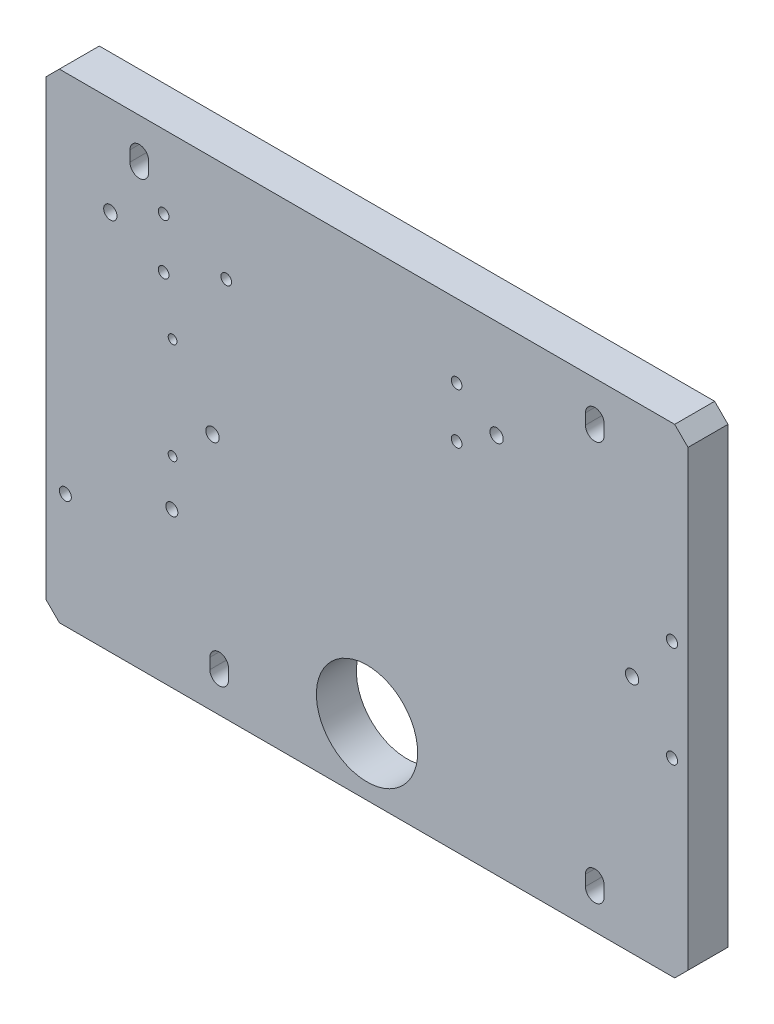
ISO-10303-21;
HEADER;
FILE_DESCRIPTION(('STEP AP214'),'2;1');
FILE_NAME('part.step','',(''),(''),'','','');
FILE_SCHEMA(('AUTOMOTIVE_DESIGN { 1 0 10303 214 1 1 1 1 }'));
ENDSEC;
DATA;
#1=APPLICATION_CONTEXT('core data for automotive mechanical design processes');
#2=APPLICATION_PROTOCOL_DEFINITION('international standard','automotive_design',2000,#1);
#3=PRODUCT_CONTEXT('',#1,'mechanical');
#4=PRODUCT('Part','Part','',(#3));
#5=PRODUCT_RELATED_PRODUCT_CATEGORY('part','',(#4));
#6=PRODUCT_DEFINITION_FORMATION('','',#4);
#7=PRODUCT_DEFINITION_CONTEXT('part definition',#1,'design');
#8=PRODUCT_DEFINITION('design','',#6,#7);
#9=PRODUCT_DEFINITION_SHAPE('','',#8);
#10=(LENGTH_UNIT() NAMED_UNIT(*) SI_UNIT(.MILLI.,.METRE.));
#11=(NAMED_UNIT(*) PLANE_ANGLE_UNIT() SI_UNIT($,.RADIAN.));
#12=(NAMED_UNIT(*) SI_UNIT($,.STERADIAN.) SOLID_ANGLE_UNIT());
#13=UNCERTAINTY_MEASURE_WITH_UNIT(LENGTH_MEASURE(1.E-05),#10,'distance_accuracy_value','');
#14=(GEOMETRIC_REPRESENTATION_CONTEXT(3) GLOBAL_UNCERTAINTY_ASSIGNED_CONTEXT((#13)) GLOBAL_UNIT_ASSIGNED_CONTEXT((#10,
#11,#12)) REPRESENTATION_CONTEXT('',''));
#15=CARTESIAN_POINT('',(0.,0.,0.));
#16=DIRECTION('',(0.,0.,1.));
#17=DIRECTION('',(1.,0.,0.));
#18=AXIS2_PLACEMENT_3D('',#15,#16,#17);
#19=CARTESIAN_POINT('',(0.,0.,5.));
#20=DIRECTION('',(0.,0.,-1.));
#21=DIRECTION('',(1.,0.,0.));
#22=AXIS2_PLACEMENT_3D('',#19,#20,#21);
#23=PLANE('',#22);
#24=CARTESIAN_POINT('',(-93.7499999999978,-14.5948159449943,5.));
#25=DIRECTION('',(0.,0.,1.));
#26=DIRECTION('',(-1.,0.,0.));
#27=AXIS2_PLACEMENT_3D('',#24,#25,#26);
#28=CIRCLE('',#27,1.65);
#29=CARTESIAN_POINT('',(-95.3999999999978,-14.5948159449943,5.));
#30=VERTEX_POINT('',#29);
#31=EDGE_CURVE('E808',#30,#30,#28,.T.);
#32=ORIENTED_EDGE('',*,*,#31,.F.);
#33=EDGE_LOOP('',(#32));
#34=FACE_BOUND('',#33,.T.);
#35=CARTESIAN_POINT('',(-78.75,0.,5.));
#36=DIRECTION('',(0.,0.,1.));
#37=DIRECTION('',(1.,0.,0.));
#38=AXIS2_PLACEMENT_3D('',#35,#36,#37);
#39=CIRCLE('',#38,2.5);
#40=CARTESIAN_POINT('',(-76.25,0.,5.));
#41=VERTEX_POINT('',#40);
#42=EDGE_CURVE('E818',#41,#41,#39,.T.);
#43=ORIENTED_EDGE('',*,*,#42,.F.);
#44=EDGE_LOOP('',(#43));
#45=FACE_BOUND('',#44,.T.);
#46=CARTESIAN_POINT('',(78.75,0.,5.));
#47=DIRECTION('',(0.,0.,1.));
#48=DIRECTION('',(1.,0.,0.));
#49=AXIS2_PLACEMENT_3D('',#46,#47,#48);
#50=CIRCLE('',#49,2.5);
#51=CARTESIAN_POINT('',(81.25,0.,5.));
#52=VERTEX_POINT('',#51);
#53=EDGE_CURVE('E824',#52,#52,#50,.T.);
#54=ORIENTED_EDGE('',*,*,#53,.F.);
#55=EDGE_LOOP('',(#54));
#56=FACE_BOUND('',#55,.T.);
#57=CARTESIAN_POINT('',(-117.109999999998,53.,5.));
#58=DIRECTION('',(0.,0.,1.));
#59=DIRECTION('',(1.,0.,0.));
#60=AXIS2_PLACEMENT_3D('',#57,#58,#59);
#61=CIRCLE('',#60,2.5);
#62=CARTESIAN_POINT('',(-114.609999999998,53.,5.));
#63=VERTEX_POINT('',#62);
#64=EDGE_CURVE('E830',#63,#63,#61,.T.);
#65=ORIENTED_EDGE('',*,*,#64,.F.);
#66=EDGE_LOOP('',(#65));
#67=FACE_BOUND('',#66,.T.);
#68=CARTESIAN_POINT('',(27.8900000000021,53.,5.));
#69=DIRECTION('',(0.,0.,1.));
#70=DIRECTION('',(1.,0.,0.));
#71=AXIS2_PLACEMENT_3D('',#68,#69,#70);
#72=CIRCLE('',#71,2.5);
#73=CARTESIAN_POINT('',(30.3900000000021,53.,5.));
#74=VERTEX_POINT('',#73);
#75=EDGE_CURVE('E836',#74,#74,#72,.T.);
#76=ORIENTED_EDGE('',*,*,#75,.F.);
#77=EDGE_LOOP('',(#76));
#78=FACE_BOUND('',#77,.T.);
#79=CARTESIAN_POINT('',(93.75,19.,5.));
#80=DIRECTION('',(0.,0.,1.));
#81=DIRECTION('',(1.,0.,0.));
#82=AXIS2_PLACEMENT_3D('',#79,#80,#81);
#83=CIRCLE('',#82,2.1);
#84=CARTESIAN_POINT('',(95.85,19.,5.));
#85=VERTEX_POINT('',#84);
#86=EDGE_CURVE('E842',#85,#85,#83,.T.);
#87=ORIENTED_EDGE('',*,*,#86,.F.);
#88=EDGE_LOOP('',(#87));
#89=FACE_BOUND('',#88,.T.);
#90=CARTESIAN_POINT('',(93.75,-19.,5.));
#91=DIRECTION('',(0.,0.,1.));
#92=DIRECTION('',(1.,0.,0.));
#93=AXIS2_PLACEMENT_3D('',#90,#91,#92);
#94=CIRCLE('',#93,2.1);
#95=CARTESIAN_POINT('',(95.85,-19.,5.));
#96=VERTEX_POINT('',#95);
#97=EDGE_CURVE('E848',#96,#96,#94,.T.);
#98=ORIENTED_EDGE('',*,*,#97,.F.);
#99=EDGE_LOOP('',(#98));
#100=FACE_BOUND('',#99,.T.);
#101=CARTESIAN_POINT('',(-20.75,-65.,5.));
#102=DIRECTION('',(0.,0.,1.));
#103=DIRECTION('',(1.,0.,0.));
#104=AXIS2_PLACEMENT_3D('',#101,#102,#103);
#105=CIRCLE('',#104,19.);
#106=CARTESIAN_POINT('',(-1.75,-65.,5.));
#107=VERTEX_POINT('',#106);
#108=EDGE_CURVE('E854',#107,#107,#105,.T.);
#109=ORIENTED_EDGE('',*,*,#108,.F.);
#110=EDGE_LOOP('',(#109));
#111=FACE_BOUND('',#110,.T.);
#112=CARTESIAN_POINT('',(-94.01,-32.,5.));
#113=DIRECTION('',(0.,0.,1.));
#114=DIRECTION('',(1.,0.,0.));
#115=AXIS2_PLACEMENT_3D('',#112,#113,#114);
#116=CIRCLE('',#115,2.25);
#117=CARTESIAN_POINT('',(-91.76,-32.,5.));
#118=VERTEX_POINT('',#117);
#119=EDGE_CURVE('E869',#118,#118,#116,.T.);
#120=ORIENTED_EDGE('',*,*,#119,.F.);
#121=EDGE_LOOP('',(#120));
#122=FACE_BOUND('',#121,.T.);
#123=CARTESIAN_POINT('',(-134.01,-47.,5.));
#124=DIRECTION('',(0.,0.,1.));
#125=DIRECTION('',(1.,0.,0.));
#126=AXIS2_PLACEMENT_3D('',#123,#124,#125);
#127=CIRCLE('',#126,2.25);
#128=CARTESIAN_POINT('',(-131.76,-47.,5.));
#129=VERTEX_POINT('',#128);
#130=EDGE_CURVE('E881',#129,#129,#127,.T.);
#131=ORIENTED_EDGE('',*,*,#130,.F.);
#132=EDGE_LOOP('',(#131));
#133=FACE_BOUND('',#132,.T.);
#134=CARTESIAN_POINT('',(-97.11,43.5,5.));
#135=DIRECTION('',(0.,0.,-1.));
#136=DIRECTION('',(-1.,0.,0.));
#137=AXIS2_PLACEMENT_3D('',#134,#135,#136);
#138=CIRCLE('',#137,2.);
#139=CARTESIAN_POINT('',(-99.11,43.5,5.));
#140=VERTEX_POINT('',#139);
#141=EDGE_CURVE('E884',#140,#140,#138,.T.);
#142=ORIENTED_EDGE('',*,*,#141,.T.);
#143=EDGE_LOOP('',(#142));
#144=FACE_BOUND('',#143,.T.);
#145=CARTESIAN_POINT('',(12.89,62.5,5.));
#146=DIRECTION('',(0.,0.,-1.));
#147=DIRECTION('',(-1.,0.,0.));
#148=AXIS2_PLACEMENT_3D('',#145,#146,#147);
#149=CIRCLE('',#148,2.);
#150=CARTESIAN_POINT('',(10.89,62.5,5.));
#151=VERTEX_POINT('',#150);
#152=EDGE_CURVE('E890',#151,#151,#149,.T.);
#153=ORIENTED_EDGE('',*,*,#152,.T.);
#154=EDGE_LOOP('',(#153));
#155=FACE_BOUND('',#154,.T.);
#156=CARTESIAN_POINT('',(-97.11,62.5,5.));
#157=DIRECTION('',(0.,0.,-1.));
#158=DIRECTION('',(-1.,0.,0.));
#159=AXIS2_PLACEMENT_3D('',#156,#157,#158);
#160=CIRCLE('',#159,2.);
#161=CARTESIAN_POINT('',(-99.11,62.5,5.));
#162=VERTEX_POINT('',#161);
#163=EDGE_CURVE('E896',#162,#162,#160,.T.);
#164=ORIENTED_EDGE('',*,*,#163,.T.);
#165=EDGE_LOOP('',(#164));
#166=FACE_BOUND('',#165,.T.);
#167=CARTESIAN_POINT('',(-73.61,53.,5.));
#168=DIRECTION('',(0.,0.,1.));
#169=DIRECTION('',(1.,0.,0.));
#170=AXIS2_PLACEMENT_3D('',#167,#168,#169);
#171=CIRCLE('',#170,2.);
#172=CARTESIAN_POINT('',(-71.61,53.,5.));
#173=VERTEX_POINT('',#172);
#174=EDGE_CURVE('E905',#173,#173,#171,.T.);
#175=ORIENTED_EDGE('',*,*,#174,.F.);
#176=EDGE_LOOP('',(#175));
#177=FACE_BOUND('',#176,.T.);
#178=CARTESIAN_POINT('',(12.89,43.5,5.));
#179=DIRECTION('',(0.,0.,1.));
#180=DIRECTION('',(1.,0.,0.));
#181=AXIS2_PLACEMENT_3D('',#178,#179,#180);
#182=CIRCLE('',#181,2.);
#183=CARTESIAN_POINT('',(14.89,43.5,5.));
#184=VERTEX_POINT('',#183);
#185=EDGE_CURVE('E210',#184,#184,#182,.T.);
#186=ORIENTED_EDGE('',*,*,#185,.F.);
#187=EDGE_LOOP('',(#186));
#188=FACE_BOUND('',#187,.T.);
#189=DIRECTION('',(0.,-1.,0.));
#190=VECTOR('',#189,1.);
#191=CARTESIAN_POINT('',(-102.75,77.,5.));
#192=LINE('',#191,#190);
#193=CARTESIAN_POINT('',(-102.75,77.,5.));
#194=VERTEX_POINT('',#193);
#195=CARTESIAN_POINT('',(-102.75,73.,5.));
#196=VERTEX_POINT('',#195);
#197=EDGE_CURVE('E184',#194,#196,#192,.T.);
#198=ORIENTED_EDGE('',*,*,#197,.T.);
#199=CARTESIAN_POINT('',(-106.25,73.,5.));
#200=DIRECTION('',(0.,0.,-1.));
#201=DIRECTION('',(-1.,0.,0.));
#202=AXIS2_PLACEMENT_3D('',#199,#200,#201);
#203=CIRCLE('',#202,3.5);
#204=CARTESIAN_POINT('',(-109.75,73.,5.));
#205=VERTEX_POINT('',#204);
#206=EDGE_CURVE('E207',#196,#205,#203,.T.);
#207=ORIENTED_EDGE('',*,*,#206,.T.);
#208=DIRECTION('',(0.,1.,0.));
#209=VECTOR('',#208,1.);
#210=CARTESIAN_POINT('',(-109.75,73.,5.));
#211=LINE('',#210,#209);
#212=CARTESIAN_POINT('',(-109.75,77.,5.));
#213=VERTEX_POINT('',#212);
#214=EDGE_CURVE('E204',#205,#213,#211,.T.);
#215=ORIENTED_EDGE('',*,*,#214,.T.);
#216=CARTESIAN_POINT('',(-106.25,77.,5.));
#217=DIRECTION('',(0.,0.,-1.));
#218=DIRECTION('',(-1.,0.,0.));
#219=AXIS2_PLACEMENT_3D('',#216,#217,#218);
#220=CIRCLE('',#219,3.5);
#221=EDGE_CURVE('E215',#213,#194,#220,.T.);
#222=ORIENTED_EDGE('',*,*,#221,.T.);
#223=EDGE_LOOP('',(#198,#207,#215,#222));
#224=FACE_BOUND('',#223,.T.);
#225=DIRECTION('',(0.,-1.,0.));
#226=VECTOR('',#225,1.);
#227=CARTESIAN_POINT('',(61.25,77.,5.));
#228=LINE('',#227,#226);
#229=CARTESIAN_POINT('',(61.25,77.,5.));
#230=VERTEX_POINT('',#229);
#231=CARTESIAN_POINT('',(61.25,73.,5.));
#232=VERTEX_POINT('',#231);
#233=EDGE_CURVE('E235',#230,#232,#228,.T.);
#234=ORIENTED_EDGE('',*,*,#233,.F.);
#235=CARTESIAN_POINT('',(64.75,77.,5.));
#236=DIRECTION('',(0.,0.,1.));
#237=DIRECTION('',(1.,0.,0.));
#238=AXIS2_PLACEMENT_3D('',#235,#236,#237);
#239=CIRCLE('',#238,3.5);
#240=CARTESIAN_POINT('',(68.25,77.,5.));
#241=VERTEX_POINT('',#240);
#242=EDGE_CURVE('E232',#241,#230,#239,.T.);
#243=ORIENTED_EDGE('',*,*,#242,.F.);
#244=DIRECTION('',(0.,1.,0.));
#245=VECTOR('',#244,1.);
#246=CARTESIAN_POINT('',(68.25,73.,5.));
#247=LINE('',#246,#245);
#248=CARTESIAN_POINT('',(68.25,73.,5.));
#249=VERTEX_POINT('',#248);
#250=EDGE_CURVE('E228',#249,#241,#247,.T.);
#251=ORIENTED_EDGE('',*,*,#250,.F.);
#252=CARTESIAN_POINT('',(64.75,73.,5.));
#253=DIRECTION('',(0.,0.,1.));
#254=DIRECTION('',(1.,0.,0.));
#255=AXIS2_PLACEMENT_3D('',#252,#253,#254);
#256=CIRCLE('',#255,3.5);
#257=EDGE_CURVE('E225',#232,#249,#256,.T.);
#258=ORIENTED_EDGE('',*,*,#257,.F.);
#259=EDGE_LOOP('',(#234,#243,#251,#258));
#260=FACE_BOUND('',#259,.T.);
#261=DIRECTION('',(0.,-1.,0.));
#262=VECTOR('',#261,1.);
#263=CARTESIAN_POINT('',(61.25,-73.,5.));
#264=LINE('',#263,#262);
#265=CARTESIAN_POINT('',(61.25,-73.,5.));
#266=VERTEX_POINT('',#265);
#267=CARTESIAN_POINT('',(61.25,-77.,5.));
#268=VERTEX_POINT('',#267);
#269=EDGE_CURVE('E267',#266,#268,#264,.T.);
#270=ORIENTED_EDGE('',*,*,#269,.F.);
#271=CARTESIAN_POINT('',(64.75,-73.,5.));
#272=DIRECTION('',(0.,0.,1.));
#273=DIRECTION('',(1.,0.,0.));
#274=AXIS2_PLACEMENT_3D('',#271,#272,#273);
#275=CIRCLE('',#274,3.5);
#276=CARTESIAN_POINT('',(68.25,-73.,5.));
#277=VERTEX_POINT('',#276);
#278=EDGE_CURVE('E264',#277,#266,#275,.T.);
#279=ORIENTED_EDGE('',*,*,#278,.F.);
#280=DIRECTION('',(0.,1.,0.));
#281=VECTOR('',#280,1.);
#282=CARTESIAN_POINT('',(68.25,-77.,5.));
#283=LINE('',#282,#281);
#284=CARTESIAN_POINT('',(68.25,-77.,5.));
#285=VERTEX_POINT('',#284);
#286=EDGE_CURVE('E260',#285,#277,#283,.T.);
#287=ORIENTED_EDGE('',*,*,#286,.F.);
#288=CARTESIAN_POINT('',(64.75,-77.,5.));
#289=DIRECTION('',(0.,0.,1.));
#290=DIRECTION('',(1.,0.,0.));
#291=AXIS2_PLACEMENT_3D('',#288,#289,#290);
#292=CIRCLE('',#291,3.5);
#293=EDGE_CURVE('E257',#268,#285,#292,.T.);
#294=ORIENTED_EDGE('',*,*,#293,.F.);
#295=EDGE_LOOP('',(#270,#279,#287,#294));
#296=FACE_BOUND('',#295,.T.);
#297=DIRECTION('',(0.,1.,0.));
#298=VECTOR('',#297,1.);
#299=CARTESIAN_POINT('',(-72.75,-77.,5.));
#300=LINE('',#299,#298);
#301=CARTESIAN_POINT('',(-72.75,-77.,5.));
#302=VERTEX_POINT('',#301);
#303=CARTESIAN_POINT('',(-72.75,-73.,5.));
#304=VERTEX_POINT('',#303);
#305=EDGE_CURVE('E299',#302,#304,#300,.T.);
#306=ORIENTED_EDGE('',*,*,#305,.F.);
#307=CARTESIAN_POINT('',(-76.25,-77.,5.));
#308=DIRECTION('',(0.,0.,1.));
#309=DIRECTION('',(1.,0.,0.));
#310=AXIS2_PLACEMENT_3D('',#307,#308,#309);
#311=CIRCLE('',#310,3.5);
#312=CARTESIAN_POINT('',(-79.75,-77.,5.));
#313=VERTEX_POINT('',#312);
#314=EDGE_CURVE('E296',#313,#302,#311,.T.);
#315=ORIENTED_EDGE('',*,*,#314,.F.);
#316=DIRECTION('',(0.,-1.,0.));
#317=VECTOR('',#316,1.);
#318=CARTESIAN_POINT('',(-79.75,-73.,5.));
#319=LINE('',#318,#317);
#320=CARTESIAN_POINT('',(-79.75,-73.,5.));
#321=VERTEX_POINT('',#320);
#322=EDGE_CURVE('E292',#321,#313,#319,.T.);
#323=ORIENTED_EDGE('',*,*,#322,.F.);
#324=CARTESIAN_POINT('',(-76.25,-73.,5.));
#325=DIRECTION('',(0.,0.,1.));
#326=DIRECTION('',(1.,0.,0.));
#327=AXIS2_PLACEMENT_3D('',#324,#325,#326);
#328=CIRCLE('',#327,3.5);
#329=EDGE_CURVE('E289',#304,#321,#328,.T.);
#330=ORIENTED_EDGE('',*,*,#329,.F.);
#331=EDGE_LOOP('',(#306,#315,#323,#330));
#332=FACE_BOUND('',#331,.T.);
#333=DIRECTION('',(1.,0.,0.));
#334=VECTOR('',#333,1.);
#335=CARTESIAN_POINT('',(-141.25,-90.,5.));
#336=LINE('',#335,#334);
#337=CARTESIAN_POINT('',(-136.25,-90.,5.));
#338=VERTEX_POINT('',#337);
#339=CARTESIAN_POINT('',(94.75,-90.,5.));
#340=VERTEX_POINT('',#339);
#341=EDGE_CURVE('E328',#338,#340,#336,.T.);
#342=ORIENTED_EDGE('',*,*,#341,.T.);
#343=DIRECTION('',(0.707106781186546,0.707106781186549,0.));
#344=VECTOR('',#343,1.);
#345=CARTESIAN_POINT('',(94.75,-90.,5.));
#346=LINE('',#345,#344);
#347=CARTESIAN_POINT('',(99.75,-85.,5.));
#348=VERTEX_POINT('',#347);
#349=EDGE_CURVE('E38',#348,#340,#346,.F.);
#350=ORIENTED_EDGE('',*,*,#349,.F.);
#351=DIRECTION('',(0.,1.,0.));
#352=VECTOR('',#351,1.);
#353=CARTESIAN_POINT('',(99.75,-90.,5.));
#354=LINE('',#353,#352);
#355=CARTESIAN_POINT('',(99.75,85.,5.));
#356=VERTEX_POINT('',#355);
#357=EDGE_CURVE('E330',#348,#356,#354,.T.);
#358=ORIENTED_EDGE('',*,*,#357,.T.);
#359=DIRECTION('',(-0.707106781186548,0.707106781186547,0.));
#360=VECTOR('',#359,1.);
#361=CARTESIAN_POINT('',(99.75,85.,5.));
#362=LINE('',#361,#360);
#363=CARTESIAN_POINT('',(94.75,90.,5.));
#364=VERTEX_POINT('',#363);
#365=EDGE_CURVE('E31',#364,#356,#362,.F.);
#366=ORIENTED_EDGE('',*,*,#365,.F.);
#367=DIRECTION('',(-1.,0.,0.));
#368=VECTOR('',#367,1.);
#369=CARTESIAN_POINT('',(99.75,90.,5.));
#370=LINE('',#369,#368);
#371=CARTESIAN_POINT('',(-136.25,90.,5.));
#372=VERTEX_POINT('',#371);
#373=EDGE_CURVE('E321',#364,#372,#370,.T.);
#374=ORIENTED_EDGE('',*,*,#373,.T.);
#375=DIRECTION('',(-0.707106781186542,-0.707106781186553,0.));
#376=VECTOR('',#375,1.);
#377=CARTESIAN_POINT('',(-136.25,90.,5.));
#378=LINE('',#377,#376);
#379=CARTESIAN_POINT('',(-141.25,85.,5.));
#380=VERTEX_POINT('',#379);
#381=EDGE_CURVE('E363',#380,#372,#378,.F.);
#382=ORIENTED_EDGE('',*,*,#381,.F.);
#383=DIRECTION('',(0.,-1.,0.));
#384=VECTOR('',#383,1.);
#385=CARTESIAN_POINT('',(-141.25,90.,5.));
#386=LINE('',#385,#384);
#387=CARTESIAN_POINT('',(-141.25,-85.,5.));
#388=VERTEX_POINT('',#387);
#389=EDGE_CURVE('E324',#380,#388,#386,.T.);
#390=ORIENTED_EDGE('',*,*,#389,.T.);
#391=DIRECTION('',(0.707106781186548,-0.707106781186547,0.));
#392=VECTOR('',#391,1.);
#393=CARTESIAN_POINT('',(-141.25,-85.,5.));
#394=LINE('',#393,#392);
#395=EDGE_CURVE('E366',#338,#388,#394,.F.);
#396=ORIENTED_EDGE('',*,*,#395,.F.);
#397=EDGE_LOOP('',(#342,#350,#358,#366,#374,#382,#390,#396));
#398=FACE_BOUND('',#397,.T.);
#399=CARTESIAN_POINT('',(-93.7499999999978,23.4051840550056,5.));
#400=DIRECTION('',(0.,0.,1.));
#401=DIRECTION('',(-1.,0.,0.));
#402=AXIS2_PLACEMENT_3D('',#399,#400,#401);
#403=CIRCLE('',#402,1.65);
#404=CARTESIAN_POINT('',(-95.3999999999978,23.4051840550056,5.));
#405=VERTEX_POINT('',#404);
#406=EDGE_CURVE('E810',#405,#405,#403,.T.);
#407=ORIENTED_EDGE('',*,*,#406,.F.);
#408=EDGE_LOOP('',(#407));
#409=FACE_BOUND('',#408,.T.);
#410=ADVANCED_FACE('F16',(#34,#45,#56,#67,#78,#89,#100,#111,#122,#133,#144,#155,#166,#177,#188,
#224,#260,#296,#332,#398,#409),#23,.F.);
#411=CARTESIAN_POINT('',(99.75,90.,5.));
#412=DIRECTION('',(0.,1.,0.));
#413=DIRECTION('',(0.,0.,-1.));
#414=AXIS2_PLACEMENT_3D('',#411,#412,#413);
#415=PLANE('',#414);
#416=ORIENTED_EDGE('',*,*,#373,.F.);
#417=DIRECTION('',(0.,0.,1.));
#418=VECTOR('',#417,1.);
#419=CARTESIAN_POINT('',(94.75,90.,5.));
#420=LINE('',#419,#418);
#421=CARTESIAN_POINT('',(94.75,90.,-10.));
#422=VERTEX_POINT('',#421);
#423=EDGE_CURVE('E24',#422,#364,#420,.T.);
#424=ORIENTED_EDGE('',*,*,#423,.F.);
#425=DIRECTION('',(-1.,0.,0.));
#426=VECTOR('',#425,1.);
#427=CARTESIAN_POINT('',(99.75,90.,-10.));
#428=LINE('',#427,#426);
#429=CARTESIAN_POINT('',(-136.25,90.,-10.));
#430=VERTEX_POINT('',#429);
#431=EDGE_CURVE('E315',#422,#430,#428,.T.);
#432=ORIENTED_EDGE('',*,*,#431,.T.);
#433=DIRECTION('',(0.,0.,-1.));
#434=VECTOR('',#433,1.);
#435=CARTESIAN_POINT('',(-136.25,90.,5.));
#436=LINE('',#435,#434);
#437=EDGE_CURVE('E11',#372,#430,#436,.T.);
#438=ORIENTED_EDGE('',*,*,#437,.F.);
#439=EDGE_LOOP('',(#416,#424,#432,#438));
#440=FACE_BOUND('',#439,.T.);
#441=ADVANCED_FACE('F376',(#440),#415,.T.);
#442=CARTESIAN_POINT('',(99.75,-90.,5.));
#443=DIRECTION('',(1.,0.,0.));
#444=DIRECTION('',(0.,0.,1.));
#445=AXIS2_PLACEMENT_3D('',#442,#443,#444);
#446=PLANE('',#445);
#447=DIRECTION('',(0.,1.,0.));
#448=VECTOR('',#447,1.);
#449=CARTESIAN_POINT('',(99.75,-90.,-10.));
#450=LINE('',#449,#448);
#451=CARTESIAN_POINT('',(99.75,-85.,-10.));
#452=VERTEX_POINT('',#451);
#453=CARTESIAN_POINT('',(99.75,85.,-10.));
#454=VERTEX_POINT('',#453);
#455=EDGE_CURVE('E325',#452,#454,#450,.T.);
#456=ORIENTED_EDGE('',*,*,#455,.T.);
#457=DIRECTION('',(0.,0.,-1.));
#458=VECTOR('',#457,1.);
#459=CARTESIAN_POINT('',(99.75,85.,5.));
#460=LINE('',#459,#458);
#461=EDGE_CURVE('E368',#356,#454,#460,.T.);
#462=ORIENTED_EDGE('',*,*,#461,.F.);
#463=ORIENTED_EDGE('',*,*,#357,.F.);
#464=DIRECTION('',(0.,0.,1.));
#465=VECTOR('',#464,1.);
#466=CARTESIAN_POINT('',(99.75,-85.,5.));
#467=LINE('',#466,#465);
#468=EDGE_CURVE('E370',#452,#348,#467,.T.);
#469=ORIENTED_EDGE('',*,*,#468,.F.);
#470=EDGE_LOOP('',(#456,#462,#463,#469));
#471=FACE_BOUND('',#470,.T.);
#472=ADVANCED_FACE('F382',(#471),#446,.T.);
#473=CARTESIAN_POINT('',(-141.25,-90.,5.));
#474=DIRECTION('',(0.,-1.,0.));
#475=DIRECTION('',(0.,0.,1.));
#476=AXIS2_PLACEMENT_3D('',#473,#474,#475);
#477=PLANE('',#476);
#478=DIRECTION('',(1.,0.,0.));
#479=VECTOR('',#478,1.);
#480=CARTESIAN_POINT('',(-141.25,-90.,-10.));
#481=LINE('',#480,#479);
#482=CARTESIAN_POINT('',(-136.25,-90.,-10.));
#483=VERTEX_POINT('',#482);
#484=CARTESIAN_POINT('',(94.75,-90.,-10.));
#485=VERTEX_POINT('',#484);
#486=EDGE_CURVE('E338',#483,#485,#481,.T.);
#487=ORIENTED_EDGE('',*,*,#486,.T.);
#488=DIRECTION('',(0.,0.,-1.));
#489=VECTOR('',#488,1.);
#490=CARTESIAN_POINT('',(94.75,-90.,5.));
#491=LINE('',#490,#489);
#492=EDGE_CURVE('E356',#340,#485,#491,.T.);
#493=ORIENTED_EDGE('',*,*,#492,.F.);
#494=ORIENTED_EDGE('',*,*,#341,.F.);
#495=DIRECTION('',(0.,0.,1.));
#496=VECTOR('',#495,1.);
#497=CARTESIAN_POINT('',(-136.25,-90.,5.));
#498=LINE('',#497,#496);
#499=EDGE_CURVE('E359',#483,#338,#498,.T.);
#500=ORIENTED_EDGE('',*,*,#499,.F.);
#501=EDGE_LOOP('',(#487,#493,#494,#500));
#502=FACE_BOUND('',#501,.T.);
#503=ADVANCED_FACE('F400',(#502),#477,.T.);
#504=CARTESIAN_POINT('',(-141.25,90.,5.));
#505=DIRECTION('',(-1.,0.,0.));
#506=DIRECTION('',(0.,0.,-1.));
#507=AXIS2_PLACEMENT_3D('',#504,#505,#506);
#508=PLANE('',#507);
#509=ORIENTED_EDGE('',*,*,#389,.F.);
#510=DIRECTION('',(0.,0.,1.));
#511=VECTOR('',#510,1.);
#512=CARTESIAN_POINT('',(-141.25,85.,5.));
#513=LINE('',#512,#511);
#514=CARTESIAN_POINT('',(-141.25,85.,-10.));
#515=VERTEX_POINT('',#514);
#516=EDGE_CURVE('E332',#515,#380,#513,.T.);
#517=ORIENTED_EDGE('',*,*,#516,.F.);
#518=DIRECTION('',(0.,-1.,0.));
#519=VECTOR('',#518,1.);
#520=CARTESIAN_POINT('',(-141.25,90.,-10.));
#521=LINE('',#520,#519);
#522=CARTESIAN_POINT('',(-141.25,-85.,-10.));
#523=VERTEX_POINT('',#522);
#524=EDGE_CURVE('E335',#515,#523,#521,.T.);
#525=ORIENTED_EDGE('',*,*,#524,.T.);
#526=DIRECTION('',(0.,0.,-1.));
#527=VECTOR('',#526,1.);
#528=CARTESIAN_POINT('',(-141.25,-85.,5.));
#529=LINE('',#528,#527);
#530=EDGE_CURVE('E345',#388,#523,#529,.T.);
#531=ORIENTED_EDGE('',*,*,#530,.F.);
#532=EDGE_LOOP('',(#509,#517,#525,#531));
#533=FACE_BOUND('',#532,.T.);
#534=ADVANCED_FACE('F393',(#533),#508,.T.);
#535=CARTESIAN_POINT('',(0.,0.,-10.));
#536=DIRECTION('',(0.,0.,-1.));
#537=DIRECTION('',(1.,0.,0.));
#538=AXIS2_PLACEMENT_3D('',#535,#536,#537);
#539=PLANE('',#538);
#540=CARTESIAN_POINT('',(-93.7499999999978,-14.5948159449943,-10.));
#541=DIRECTION('',(0.,0.,-1.));
#542=DIRECTION('',(1.,0.,0.));
#543=AXIS2_PLACEMENT_3D('',#540,#541,#542);
#544=CIRCLE('',#543,1.65);
#545=CARTESIAN_POINT('',(-92.0999999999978,-14.5948159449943,-10.));
#546=VERTEX_POINT('',#545);
#547=EDGE_CURVE('E806',#546,#546,#544,.T.);
#548=ORIENTED_EDGE('',*,*,#547,.F.);
#549=EDGE_LOOP('',(#548));
#550=FACE_BOUND('',#549,.T.);
#551=CARTESIAN_POINT('',(-93.7499999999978,23.4051840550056,-10.));
#552=DIRECTION('',(0.,0.,-1.));
#553=DIRECTION('',(1.,0.,0.));
#554=AXIS2_PLACEMENT_3D('',#551,#552,#553);
#555=CIRCLE('',#554,1.65);
#556=CARTESIAN_POINT('',(-92.0999999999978,23.4051840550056,-10.));
#557=VERTEX_POINT('',#556);
#558=EDGE_CURVE('E815',#557,#557,#555,.T.);
#559=ORIENTED_EDGE('',*,*,#558,.F.);
#560=EDGE_LOOP('',(#559));
#561=FACE_BOUND('',#560,.T.);
#562=CARTESIAN_POINT('',(-78.75,0.,-10.));
#563=DIRECTION('',(0.,0.,1.));
#564=DIRECTION('',(1.,0.,0.));
#565=AXIS2_PLACEMENT_3D('',#562,#563,#564);
#566=CIRCLE('',#565,2.5);
#567=CARTESIAN_POINT('',(-76.25,0.,-10.));
#568=VERTEX_POINT('',#567);
#569=EDGE_CURVE('E821',#568,#568,#566,.T.);
#570=ORIENTED_EDGE('',*,*,#569,.T.);
#571=EDGE_LOOP('',(#570));
#572=FACE_BOUND('',#571,.T.);
#573=CARTESIAN_POINT('',(78.75,0.,-10.));
#574=DIRECTION('',(0.,0.,1.));
#575=DIRECTION('',(1.,0.,0.));
#576=AXIS2_PLACEMENT_3D('',#573,#574,#575);
#577=CIRCLE('',#576,2.5);
#578=CARTESIAN_POINT('',(81.25,0.,-10.));
#579=VERTEX_POINT('',#578);
#580=EDGE_CURVE('E827',#579,#579,#577,.T.);
#581=ORIENTED_EDGE('',*,*,#580,.T.);
#582=EDGE_LOOP('',(#581));
#583=FACE_BOUND('',#582,.T.);
#584=CARTESIAN_POINT('',(-117.109999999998,53.,-10.));
#585=DIRECTION('',(0.,0.,1.));
#586=DIRECTION('',(1.,0.,0.));
#587=AXIS2_PLACEMENT_3D('',#584,#585,#586);
#588=CIRCLE('',#587,2.5);
#589=CARTESIAN_POINT('',(-114.609999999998,53.,-10.));
#590=VERTEX_POINT('',#589);
#591=EDGE_CURVE('E833',#590,#590,#588,.T.);
#592=ORIENTED_EDGE('',*,*,#591,.T.);
#593=EDGE_LOOP('',(#592));
#594=FACE_BOUND('',#593,.T.);
#595=CARTESIAN_POINT('',(27.8900000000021,53.,-10.));
#596=DIRECTION('',(0.,0.,1.));
#597=DIRECTION('',(1.,0.,0.));
#598=AXIS2_PLACEMENT_3D('',#595,#596,#597);
#599=CIRCLE('',#598,2.5);
#600=CARTESIAN_POINT('',(30.3900000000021,53.,-10.));
#601=VERTEX_POINT('',#600);
#602=EDGE_CURVE('E839',#601,#601,#599,.T.);
#603=ORIENTED_EDGE('',*,*,#602,.T.);
#604=EDGE_LOOP('',(#603));
#605=FACE_BOUND('',#604,.T.);
#606=CARTESIAN_POINT('',(93.75,19.,-10.));
#607=DIRECTION('',(0.,0.,1.));
#608=DIRECTION('',(1.,0.,0.));
#609=AXIS2_PLACEMENT_3D('',#606,#607,#608);
#610=CIRCLE('',#609,2.1);
#611=CARTESIAN_POINT('',(95.85,19.,-10.));
#612=VERTEX_POINT('',#611);
#613=EDGE_CURVE('E845',#612,#612,#610,.T.);
#614=ORIENTED_EDGE('',*,*,#613,.T.);
#615=EDGE_LOOP('',(#614));
#616=FACE_BOUND('',#615,.T.);
#617=CARTESIAN_POINT('',(93.75,-19.,-10.));
#618=DIRECTION('',(0.,0.,1.));
#619=DIRECTION('',(1.,0.,0.));
#620=AXIS2_PLACEMENT_3D('',#617,#618,#619);
#621=CIRCLE('',#620,2.1);
#622=CARTESIAN_POINT('',(95.85,-19.,-10.));
#623=VERTEX_POINT('',#622);
#624=EDGE_CURVE('E851',#623,#623,#621,.T.);
#625=ORIENTED_EDGE('',*,*,#624,.T.);
#626=EDGE_LOOP('',(#625));
#627=FACE_BOUND('',#626,.T.);
#628=CARTESIAN_POINT('',(-20.75,-65.,-10.));
#629=DIRECTION('',(0.,0.,1.));
#630=DIRECTION('',(1.,0.,0.));
#631=AXIS2_PLACEMENT_3D('',#628,#629,#630);
#632=CIRCLE('',#631,19.);
#633=CARTESIAN_POINT('',(-1.75,-65.,-10.));
#634=VERTEX_POINT('',#633);
#635=EDGE_CURVE('E855',#634,#634,#632,.T.);
#636=ORIENTED_EDGE('',*,*,#635,.T.);
#637=EDGE_LOOP('',(#636));
#638=FACE_BOUND('',#637,.T.);
#639=CARTESIAN_POINT('',(-94.01,-32.,-10.));
#640=DIRECTION('',(0.,0.,1.));
#641=DIRECTION('',(1.,0.,0.));
#642=AXIS2_PLACEMENT_3D('',#639,#640,#641);
#643=CIRCLE('',#642,4.);
#644=CARTESIAN_POINT('',(-90.01,-32.,-10.));
#645=VERTEX_POINT('',#644);
#646=EDGE_CURVE('E858',#645,#645,#643,.T.);
#647=ORIENTED_EDGE('',*,*,#646,.T.);
#648=EDGE_LOOP('',(#647));
#649=FACE_BOUND('',#648,.T.);
#650=CARTESIAN_POINT('',(-134.01,-47.,-10.));
#651=DIRECTION('',(0.,0.,1.));
#652=DIRECTION('',(1.,0.,0.));
#653=AXIS2_PLACEMENT_3D('',#650,#651,#652);
#654=CIRCLE('',#653,4.);
#655=CARTESIAN_POINT('',(-130.01,-47.,-10.));
#656=VERTEX_POINT('',#655);
#657=EDGE_CURVE('E872',#656,#656,#654,.T.);
#658=ORIENTED_EDGE('',*,*,#657,.T.);
#659=EDGE_LOOP('',(#658));
#660=FACE_BOUND('',#659,.T.);
#661=CARTESIAN_POINT('',(-97.11,43.5,-10.));
#662=DIRECTION('',(0.,0.,-1.));
#663=DIRECTION('',(-1.,0.,0.));
#664=AXIS2_PLACEMENT_3D('',#661,#662,#663);
#665=CIRCLE('',#664,2.);
#666=CARTESIAN_POINT('',(-99.11,43.5,-10.));
#667=VERTEX_POINT('',#666);
#668=EDGE_CURVE('E887',#667,#667,#665,.T.);
#669=ORIENTED_EDGE('',*,*,#668,.F.);
#670=EDGE_LOOP('',(#669));
#671=FACE_BOUND('',#670,.T.);
#672=CARTESIAN_POINT('',(12.89,62.5,-10.));
#673=DIRECTION('',(0.,0.,-1.));
#674=DIRECTION('',(-1.,0.,0.));
#675=AXIS2_PLACEMENT_3D('',#672,#673,#674);
#676=CIRCLE('',#675,2.);
#677=CARTESIAN_POINT('',(10.89,62.5,-10.));
#678=VERTEX_POINT('',#677);
#679=EDGE_CURVE('E893',#678,#678,#676,.T.);
#680=ORIENTED_EDGE('',*,*,#679,.F.);
#681=EDGE_LOOP('',(#680));
#682=FACE_BOUND('',#681,.T.);
#683=CARTESIAN_POINT('',(-97.11,62.5,-10.));
#684=DIRECTION('',(0.,0.,-1.));
#685=DIRECTION('',(-1.,0.,0.));
#686=AXIS2_PLACEMENT_3D('',#683,#684,#685);
#687=CIRCLE('',#686,2.);
#688=CARTESIAN_POINT('',(-99.11,62.5,-10.));
#689=VERTEX_POINT('',#688);
#690=EDGE_CURVE('E899',#689,#689,#687,.T.);
#691=ORIENTED_EDGE('',*,*,#690,.F.);
#692=EDGE_LOOP('',(#691));
#693=FACE_BOUND('',#692,.T.);
#694=CARTESIAN_POINT('',(-73.61,53.,-10.));
#695=DIRECTION('',(0.,0.,1.));
#696=DIRECTION('',(1.,0.,0.));
#697=AXIS2_PLACEMENT_3D('',#694,#695,#696);
#698=CIRCLE('',#697,2.);
#699=CARTESIAN_POINT('',(-71.61,53.,-10.));
#700=VERTEX_POINT('',#699);
#701=EDGE_CURVE('E902',#700,#700,#698,.T.);
#702=ORIENTED_EDGE('',*,*,#701,.T.);
#703=EDGE_LOOP('',(#702));
#704=FACE_BOUND('',#703,.T.);
#705=CARTESIAN_POINT('',(12.89,43.5,-10.));
#706=DIRECTION('',(0.,0.,1.));
#707=DIRECTION('',(1.,0.,0.));
#708=AXIS2_PLACEMENT_3D('',#705,#706,#707);
#709=CIRCLE('',#708,2.);
#710=CARTESIAN_POINT('',(14.89,43.5,-10.));
#711=VERTEX_POINT('',#710);
#712=EDGE_CURVE('E907',#711,#711,#709,.T.);
#713=ORIENTED_EDGE('',*,*,#712,.T.);
#714=EDGE_LOOP('',(#713));
#715=FACE_BOUND('',#714,.T.);
#716=CARTESIAN_POINT('',(-106.25,77.,-10.));
#717=DIRECTION('',(0.,0.,-1.));
#718=DIRECTION('',(-1.,0.,0.));
#719=AXIS2_PLACEMENT_3D('',#716,#717,#718);
#720=CIRCLE('',#719,3.5);
#721=CARTESIAN_POINT('',(-109.75,77.,-10.));
#722=VERTEX_POINT('',#721);
#723=CARTESIAN_POINT('',(-102.75,77.,-10.));
#724=VERTEX_POINT('',#723);
#725=EDGE_CURVE('E197',#722,#724,#720,.T.);
#726=ORIENTED_EDGE('',*,*,#725,.F.);
#727=DIRECTION('',(0.,1.,0.));
#728=VECTOR('',#727,1.);
#729=CARTESIAN_POINT('',(-109.75,73.,-10.));
#730=LINE('',#729,#728);
#731=CARTESIAN_POINT('',(-109.75,73.,-10.));
#732=VERTEX_POINT('',#731);
#733=EDGE_CURVE('E190',#732,#722,#730,.T.);
#734=ORIENTED_EDGE('',*,*,#733,.F.);
#735=CARTESIAN_POINT('',(-106.25,73.,-10.));
#736=DIRECTION('',(0.,0.,-1.));
#737=DIRECTION('',(-1.,0.,0.));
#738=AXIS2_PLACEMENT_3D('',#735,#736,#737);
#739=CIRCLE('',#738,3.5);
#740=CARTESIAN_POINT('',(-102.75,73.,-10.));
#741=VERTEX_POINT('',#740);
#742=EDGE_CURVE('E199',#741,#732,#739,.T.);
#743=ORIENTED_EDGE('',*,*,#742,.F.);
#744=DIRECTION('',(0.,-1.,0.));
#745=VECTOR('',#744,1.);
#746=CARTESIAN_POINT('',(-102.75,77.,-10.));
#747=LINE('',#746,#745);
#748=EDGE_CURVE('E181',#724,#741,#747,.T.);
#749=ORIENTED_EDGE('',*,*,#748,.F.);
#750=EDGE_LOOP('',(#726,#734,#743,#749));
#751=FACE_BOUND('',#750,.T.);
#752=CARTESIAN_POINT('',(64.75,73.,-10.));
#753=DIRECTION('',(0.,0.,1.));
#754=DIRECTION('',(1.,0.,0.));
#755=AXIS2_PLACEMENT_3D('',#752,#753,#754);
#756=CIRCLE('',#755,3.5);
#757=CARTESIAN_POINT('',(61.25,73.,-10.));
#758=VERTEX_POINT('',#757);
#759=CARTESIAN_POINT('',(68.25,73.,-10.));
#760=VERTEX_POINT('',#759);
#761=EDGE_CURVE('E221',#758,#760,#756,.T.);
#762=ORIENTED_EDGE('',*,*,#761,.T.);
#763=DIRECTION('',(0.,1.,0.));
#764=VECTOR('',#763,1.);
#765=CARTESIAN_POINT('',(68.25,73.,-10.));
#766=LINE('',#765,#764);
#767=CARTESIAN_POINT('',(68.25,77.,-10.));
#768=VERTEX_POINT('',#767);
#769=EDGE_CURVE('E241',#760,#768,#766,.T.);
#770=ORIENTED_EDGE('',*,*,#769,.T.);
#771=CARTESIAN_POINT('',(64.75,77.,-10.));
#772=DIRECTION('',(0.,0.,1.));
#773=DIRECTION('',(1.,0.,0.));
#774=AXIS2_PLACEMENT_3D('',#771,#772,#773);
#775=CIRCLE('',#774,3.5);
#776=CARTESIAN_POINT('',(61.25,77.,-10.));
#777=VERTEX_POINT('',#776);
#778=EDGE_CURVE('E244',#768,#777,#775,.T.);
#779=ORIENTED_EDGE('',*,*,#778,.T.);
#780=DIRECTION('',(0.,-1.,0.));
#781=VECTOR('',#780,1.);
#782=CARTESIAN_POINT('',(61.25,77.,-10.));
#783=LINE('',#782,#781);
#784=EDGE_CURVE('E229',#777,#758,#783,.T.);
#785=ORIENTED_EDGE('',*,*,#784,.T.);
#786=EDGE_LOOP('',(#762,#770,#779,#785));
#787=FACE_BOUND('',#786,.T.);
#788=CARTESIAN_POINT('',(64.75,-77.,-10.));
#789=DIRECTION('',(0.,0.,1.));
#790=DIRECTION('',(1.,0.,0.));
#791=AXIS2_PLACEMENT_3D('',#788,#789,#790);
#792=CIRCLE('',#791,3.5);
#793=CARTESIAN_POINT('',(61.25,-77.,-10.));
#794=VERTEX_POINT('',#793);
#795=CARTESIAN_POINT('',(68.25,-77.,-10.));
#796=VERTEX_POINT('',#795);
#797=EDGE_CURVE('E251',#794,#796,#792,.T.);
#798=ORIENTED_EDGE('',*,*,#797,.T.);
#799=DIRECTION('',(0.,1.,0.));
#800=VECTOR('',#799,1.);
#801=CARTESIAN_POINT('',(68.25,-77.,-10.));
#802=LINE('',#801,#800);
#803=CARTESIAN_POINT('',(68.25,-73.,-10.));
#804=VERTEX_POINT('',#803);
#805=EDGE_CURVE('E273',#796,#804,#802,.T.);
#806=ORIENTED_EDGE('',*,*,#805,.T.);
#807=CARTESIAN_POINT('',(64.75,-73.,-10.));
#808=DIRECTION('',(0.,0.,1.));
#809=DIRECTION('',(1.,0.,0.));
#810=AXIS2_PLACEMENT_3D('',#807,#808,#809);
#811=CIRCLE('',#810,3.5);
#812=CARTESIAN_POINT('',(61.25,-73.,-10.));
#813=VERTEX_POINT('',#812);
#814=EDGE_CURVE('E276',#804,#813,#811,.T.);
#815=ORIENTED_EDGE('',*,*,#814,.T.);
#816=DIRECTION('',(0.,-1.,0.));
#817=VECTOR('',#816,1.);
#818=CARTESIAN_POINT('',(61.25,-73.,-10.));
#819=LINE('',#818,#817);
#820=EDGE_CURVE('E261',#813,#794,#819,.T.);
#821=ORIENTED_EDGE('',*,*,#820,.T.);
#822=EDGE_LOOP('',(#798,#806,#815,#821));
#823=FACE_BOUND('',#822,.T.);
#824=CARTESIAN_POINT('',(-76.25,-73.,-10.));
#825=DIRECTION('',(0.,0.,1.));
#826=DIRECTION('',(1.,0.,0.));
#827=AXIS2_PLACEMENT_3D('',#824,#825,#826);
#828=CIRCLE('',#827,3.5);
#829=CARTESIAN_POINT('',(-72.75,-73.,-10.));
#830=VERTEX_POINT('',#829);
#831=CARTESIAN_POINT('',(-79.75,-73.,-10.));
#832=VERTEX_POINT('',#831);
#833=EDGE_CURVE('E283',#830,#832,#828,.T.);
#834=ORIENTED_EDGE('',*,*,#833,.T.);
#835=DIRECTION('',(0.,-1.,0.));
#836=VECTOR('',#835,1.);
#837=CARTESIAN_POINT('',(-79.75,-73.,-10.));
#838=LINE('',#837,#836);
#839=CARTESIAN_POINT('',(-79.75,-77.,-10.));
#840=VERTEX_POINT('',#839);
#841=EDGE_CURVE('E305',#832,#840,#838,.T.);
#842=ORIENTED_EDGE('',*,*,#841,.T.);
#843=CARTESIAN_POINT('',(-76.25,-77.,-10.));
#844=DIRECTION('',(0.,0.,1.));
#845=DIRECTION('',(1.,0.,0.));
#846=AXIS2_PLACEMENT_3D('',#843,#844,#845);
#847=CIRCLE('',#846,3.5);
#848=CARTESIAN_POINT('',(-72.75,-77.,-10.));
#849=VERTEX_POINT('',#848);
#850=EDGE_CURVE('E308',#840,#849,#847,.T.);
#851=ORIENTED_EDGE('',*,*,#850,.T.);
#852=DIRECTION('',(0.,1.,0.));
#853=VECTOR('',#852,1.);
#854=CARTESIAN_POINT('',(-72.75,-77.,-10.));
#855=LINE('',#854,#853);
#856=EDGE_CURVE('E293',#849,#830,#855,.T.);
#857=ORIENTED_EDGE('',*,*,#856,.T.);
#858=EDGE_LOOP('',(#834,#842,#851,#857));
#859=FACE_BOUND('',#858,.T.);
#860=ORIENTED_EDGE('',*,*,#524,.F.);
#861=DIRECTION('',(0.707106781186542,0.707106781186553,0.));
#862=VECTOR('',#861,1.);
#863=CARTESIAN_POINT('',(-113.125000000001,113.125,-10.));
#864=LINE('',#863,#862);
#865=EDGE_CURVE('E350',#430,#515,#864,.F.);
#866=ORIENTED_EDGE('',*,*,#865,.F.);
#867=ORIENTED_EDGE('',*,*,#431,.F.);
#868=DIRECTION('',(0.707106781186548,-0.707106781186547,0.));
#869=VECTOR('',#868,1.);
#870=CARTESIAN_POINT('',(92.375,92.375,-10.));
#871=LINE('',#870,#869);
#872=EDGE_CURVE('E348',#454,#422,#871,.F.);
#873=ORIENTED_EDGE('',*,*,#872,.F.);
#874=ORIENTED_EDGE('',*,*,#455,.F.);
#875=DIRECTION('',(-0.707106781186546,-0.707106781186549,0.));
#876=VECTOR('',#875,1.);
#877=CARTESIAN_POINT('',(92.375,-92.375,-10.));
#878=LINE('',#877,#876);
#879=EDGE_CURVE('E352',#485,#452,#878,.F.);
#880=ORIENTED_EDGE('',*,*,#879,.F.);
#881=ORIENTED_EDGE('',*,*,#486,.F.);
#882=DIRECTION('',(-0.707106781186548,0.707106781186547,0.));
#883=VECTOR('',#882,1.);
#884=CARTESIAN_POINT('',(-113.125,-113.125,-10.));
#885=LINE('',#884,#883);
#886=EDGE_CURVE('E354',#523,#483,#885,.F.);
#887=ORIENTED_EDGE('',*,*,#886,.F.);
#888=EDGE_LOOP('',(#860,#866,#867,#873,#874,#880,#881,#887));
#889=FACE_BOUND('',#888,.T.);
#890=ADVANCED_FACE('F194',(#550,#561,#572,#583,#594,#605,#616,#627,#638,#649,#660,#671,#682,
#693,#704,#715,#751,#787,#823,#859,#889),#539,.T.);
#891=CARTESIAN_POINT('',(-76.25,-73.,5.));
#892=DIRECTION('',(0.,0.,-1.));
#893=DIRECTION('',(1.,0.,0.));
#894=AXIS2_PLACEMENT_3D('',#891,#892,#893);
#895=CYLINDRICAL_SURFACE('',#894,3.5);
#896=ORIENTED_EDGE('',*,*,#833,.F.);
#897=DIRECTION('',(0.,0.,-1.));
#898=VECTOR('',#897,1.);
#899=CARTESIAN_POINT('',(-72.75,-73.,5.));
#900=LINE('',#899,#898);
#901=EDGE_CURVE('E313',#304,#830,#900,.T.);
#902=ORIENTED_EDGE('',*,*,#901,.F.);
#903=ORIENTED_EDGE('',*,*,#329,.T.);
#904=DIRECTION('',(0.,0.,-1.));
#905=VECTOR('',#904,1.);
#906=CARTESIAN_POINT('',(-79.75,-73.,5.));
#907=LINE('',#906,#905);
#908=EDGE_CURVE('E302',#321,#832,#907,.T.);
#909=ORIENTED_EDGE('',*,*,#908,.T.);
#910=EDGE_LOOP('',(#896,#902,#903,#909));
#911=FACE_BOUND('',#910,.T.);
#912=ADVANCED_FACE('F425',(#911),#895,.F.);
#913=CARTESIAN_POINT('',(-72.75,-77.,5.));
#914=DIRECTION('',(1.,0.,0.));
#915=DIRECTION('',(0.,0.,1.));
#916=AXIS2_PLACEMENT_3D('',#913,#914,#915);
#917=PLANE('',#916);
#918=ORIENTED_EDGE('',*,*,#856,.F.);
#919=DIRECTION('',(0.,0.,-1.));
#920=VECTOR('',#919,1.);
#921=CARTESIAN_POINT('',(-72.75,-77.,5.));
#922=LINE('',#921,#920);
#923=EDGE_CURVE('E316',#302,#849,#922,.T.);
#924=ORIENTED_EDGE('',*,*,#923,.F.);
#925=ORIENTED_EDGE('',*,*,#305,.T.);
#926=ORIENTED_EDGE('',*,*,#901,.T.);
#927=EDGE_LOOP('',(#918,#924,#925,#926));
#928=FACE_BOUND('',#927,.T.);
#929=ADVANCED_FACE('F456',(#928),#917,.F.);
#930=CARTESIAN_POINT('',(-76.25,-77.,5.));
#931=DIRECTION('',(0.,0.,-1.));
#932=DIRECTION('',(1.,0.,0.));
#933=AXIS2_PLACEMENT_3D('',#930,#931,#932);
#934=CYLINDRICAL_SURFACE('',#933,3.5);
#935=ORIENTED_EDGE('',*,*,#850,.F.);
#936=DIRECTION('',(0.,0.,-1.));
#937=VECTOR('',#936,1.);
#938=CARTESIAN_POINT('',(-79.75,-77.,5.));
#939=LINE('',#938,#937);
#940=EDGE_CURVE('E318',#313,#840,#939,.T.);
#941=ORIENTED_EDGE('',*,*,#940,.F.);
#942=ORIENTED_EDGE('',*,*,#314,.T.);
#943=ORIENTED_EDGE('',*,*,#923,.T.);
#944=EDGE_LOOP('',(#935,#941,#942,#943));
#945=FACE_BOUND('',#944,.T.);
#946=ADVANCED_FACE('F464',(#945),#934,.F.);
#947=CARTESIAN_POINT('',(-79.75,-73.,5.));
#948=DIRECTION('',(-1.,0.,0.));
#949=DIRECTION('',(0.,0.,-1.));
#950=AXIS2_PLACEMENT_3D('',#947,#948,#949);
#951=PLANE('',#950);
#952=ORIENTED_EDGE('',*,*,#841,.F.);
#953=ORIENTED_EDGE('',*,*,#908,.F.);
#954=ORIENTED_EDGE('',*,*,#322,.T.);
#955=ORIENTED_EDGE('',*,*,#940,.T.);
#956=EDGE_LOOP('',(#952,#953,#954,#955));
#957=FACE_BOUND('',#956,.T.);
#958=ADVANCED_FACE('F473',(#957),#951,.F.);
#959=CARTESIAN_POINT('',(64.75,-77.,5.));
#960=DIRECTION('',(0.,0.,-1.));
#961=DIRECTION('',(1.,0.,0.));
#962=AXIS2_PLACEMENT_3D('',#959,#960,#961);
#963=CYLINDRICAL_SURFACE('',#962,3.5);
#964=ORIENTED_EDGE('',*,*,#797,.F.);
#965=DIRECTION('',(0.,0.,-1.));
#966=VECTOR('',#965,1.);
#967=CARTESIAN_POINT('',(61.25,-77.,5.));
#968=LINE('',#967,#966);
#969=EDGE_CURVE('E281',#268,#794,#968,.T.);
#970=ORIENTED_EDGE('',*,*,#969,.F.);
#971=ORIENTED_EDGE('',*,*,#293,.T.);
#972=DIRECTION('',(0.,0.,-1.));
#973=VECTOR('',#972,1.);
#974=CARTESIAN_POINT('',(68.25,-77.,5.));
#975=LINE('',#974,#973);
#976=EDGE_CURVE('E270',#285,#796,#975,.T.);
#977=ORIENTED_EDGE('',*,*,#976,.T.);
#978=EDGE_LOOP('',(#964,#970,#971,#977));
#979=FACE_BOUND('',#978,.T.);
#980=ADVANCED_FACE('F482',(#979),#963,.F.);
#981=CARTESIAN_POINT('',(61.25,-73.,5.));
#982=DIRECTION('',(-1.,0.,0.));
#983=DIRECTION('',(0.,0.,-1.));
#984=AXIS2_PLACEMENT_3D('',#981,#982,#983);
#985=PLANE('',#984);
#986=ORIENTED_EDGE('',*,*,#820,.F.);
#987=DIRECTION('',(0.,0.,-1.));
#988=VECTOR('',#987,1.);
#989=CARTESIAN_POINT('',(61.25,-73.,5.));
#990=LINE('',#989,#988);
#991=EDGE_CURVE('E284',#266,#813,#990,.T.);
#992=ORIENTED_EDGE('',*,*,#991,.F.);
#993=ORIENTED_EDGE('',*,*,#269,.T.);
#994=ORIENTED_EDGE('',*,*,#969,.T.);
#995=EDGE_LOOP('',(#986,#992,#993,#994));
#996=FACE_BOUND('',#995,.T.);
#997=ADVANCED_FACE('F490',(#996),#985,.F.);
#998=CARTESIAN_POINT('',(64.75,-73.,5.));
#999=DIRECTION('',(0.,0.,-1.));
#1000=DIRECTION('',(1.,0.,0.));
#1001=AXIS2_PLACEMENT_3D('',#998,#999,#1000);
#1002=CYLINDRICAL_SURFACE('',#1001,3.5);
#1003=ORIENTED_EDGE('',*,*,#814,.F.);
#1004=DIRECTION('',(0.,0.,-1.));
#1005=VECTOR('',#1004,1.);
#1006=CARTESIAN_POINT('',(68.25,-73.,5.));
#1007=LINE('',#1006,#1005);
#1008=EDGE_CURVE('E286',#277,#804,#1007,.T.);
#1009=ORIENTED_EDGE('',*,*,#1008,.F.);
#1010=ORIENTED_EDGE('',*,*,#278,.T.);
#1011=ORIENTED_EDGE('',*,*,#991,.T.);
#1012=EDGE_LOOP('',(#1003,#1009,#1010,#1011));
#1013=FACE_BOUND('',#1012,.T.);
#1014=ADVANCED_FACE('F499',(#1013),#1002,.F.);
#1015=CARTESIAN_POINT('',(68.25,-77.,5.));
#1016=DIRECTION('',(1.,0.,0.));
#1017=DIRECTION('',(0.,0.,1.));
#1018=AXIS2_PLACEMENT_3D('',#1015,#1016,#1017);
#1019=PLANE('',#1018);
#1020=ORIENTED_EDGE('',*,*,#805,.F.);
#1021=ORIENTED_EDGE('',*,*,#976,.F.);
#1022=ORIENTED_EDGE('',*,*,#286,.T.);
#1023=ORIENTED_EDGE('',*,*,#1008,.T.);
#1024=EDGE_LOOP('',(#1020,#1021,#1022,#1023));
#1025=FACE_BOUND('',#1024,.T.);
#1026=ADVANCED_FACE('F508',(#1025),#1019,.F.);
#1027=CARTESIAN_POINT('',(64.75,73.,5.));
#1028=DIRECTION('',(0.,0.,-1.));
#1029=DIRECTION('',(1.,0.,0.));
#1030=AXIS2_PLACEMENT_3D('',#1027,#1028,#1029);
#1031=CYLINDRICAL_SURFACE('',#1030,3.5);
#1032=ORIENTED_EDGE('',*,*,#761,.F.);
#1033=DIRECTION('',(0.,0.,-1.));
#1034=VECTOR('',#1033,1.);
#1035=CARTESIAN_POINT('',(61.25,73.,5.));
#1036=LINE('',#1035,#1034);
#1037=EDGE_CURVE('E249',#232,#758,#1036,.T.);
#1038=ORIENTED_EDGE('',*,*,#1037,.F.);
#1039=ORIENTED_EDGE('',*,*,#257,.T.);
#1040=DIRECTION('',(0.,0.,-1.));
#1041=VECTOR('',#1040,1.);
#1042=CARTESIAN_POINT('',(68.25,73.,5.));
#1043=LINE('',#1042,#1041);
#1044=EDGE_CURVE('E238',#249,#760,#1043,.T.);
#1045=ORIENTED_EDGE('',*,*,#1044,.T.);
#1046=EDGE_LOOP('',(#1032,#1038,#1039,#1045));
#1047=FACE_BOUND('',#1046,.T.);
#1048=ADVANCED_FACE('F517',(#1047),#1031,.F.);
#1049=CARTESIAN_POINT('',(61.25,77.,5.));
#1050=DIRECTION('',(-1.,0.,0.));
#1051=DIRECTION('',(0.,0.,-1.));
#1052=AXIS2_PLACEMENT_3D('',#1049,#1050,#1051);
#1053=PLANE('',#1052);
#1054=ORIENTED_EDGE('',*,*,#784,.F.);
#1055=DIRECTION('',(0.,0.,-1.));
#1056=VECTOR('',#1055,1.);
#1057=CARTESIAN_POINT('',(61.25,77.,5.));
#1058=LINE('',#1057,#1056);
#1059=EDGE_CURVE('E252',#230,#777,#1058,.T.);
#1060=ORIENTED_EDGE('',*,*,#1059,.F.);
#1061=ORIENTED_EDGE('',*,*,#233,.T.);
#1062=ORIENTED_EDGE('',*,*,#1037,.T.);
#1063=EDGE_LOOP('',(#1054,#1060,#1061,#1062));
#1064=FACE_BOUND('',#1063,.T.);
#1065=ADVANCED_FACE('F526',(#1064),#1053,.F.);
#1066=CARTESIAN_POINT('',(64.75,77.,5.));
#1067=DIRECTION('',(0.,0.,-1.));
#1068=DIRECTION('',(1.,0.,0.));
#1069=AXIS2_PLACEMENT_3D('',#1066,#1067,#1068);
#1070=CYLINDRICAL_SURFACE('',#1069,3.5);
#1071=ORIENTED_EDGE('',*,*,#778,.F.);
#1072=DIRECTION('',(0.,0.,-1.));
#1073=VECTOR('',#1072,1.);
#1074=CARTESIAN_POINT('',(68.25,77.,5.));
#1075=LINE('',#1074,#1073);
#1076=EDGE_CURVE('E254',#241,#768,#1075,.T.);
#1077=ORIENTED_EDGE('',*,*,#1076,.F.);
#1078=ORIENTED_EDGE('',*,*,#242,.T.);
#1079=ORIENTED_EDGE('',*,*,#1059,.T.);
#1080=EDGE_LOOP('',(#1071,#1077,#1078,#1079));
#1081=FACE_BOUND('',#1080,.T.);
#1082=ADVANCED_FACE('F535',(#1081),#1070,.F.);
#1083=CARTESIAN_POINT('',(68.25,73.,5.));
#1084=DIRECTION('',(1.,0.,0.));
#1085=DIRECTION('',(0.,0.,1.));
#1086=AXIS2_PLACEMENT_3D('',#1083,#1084,#1085);
#1087=PLANE('',#1086);
#1088=ORIENTED_EDGE('',*,*,#769,.F.);
#1089=ORIENTED_EDGE('',*,*,#1044,.F.);
#1090=ORIENTED_EDGE('',*,*,#250,.T.);
#1091=ORIENTED_EDGE('',*,*,#1076,.T.);
#1092=EDGE_LOOP('',(#1088,#1089,#1090,#1091));
#1093=FACE_BOUND('',#1092,.T.);
#1094=ADVANCED_FACE('F544',(#1093),#1087,.F.);
#1095=CARTESIAN_POINT('',(-106.25,77.,-10.));
#1096=DIRECTION('',(0.,0.,1.));
#1097=DIRECTION('',(-1.,0.,0.));
#1098=AXIS2_PLACEMENT_3D('',#1095,#1096,#1097);
#1099=CYLINDRICAL_SURFACE('',#1098,3.5);
#1100=ORIENTED_EDGE('',*,*,#221,.F.);
#1101=DIRECTION('',(0.,0.,1.));
#1102=VECTOR('',#1101,1.);
#1103=CARTESIAN_POINT('',(-109.75,77.,-10.));
#1104=LINE('',#1103,#1102);
#1105=EDGE_CURVE('E202',#722,#213,#1104,.T.);
#1106=ORIENTED_EDGE('',*,*,#1105,.F.);
#1107=ORIENTED_EDGE('',*,*,#725,.T.);
#1108=DIRECTION('',(0.,0.,1.));
#1109=VECTOR('',#1108,1.);
#1110=CARTESIAN_POINT('',(-102.75,77.,-10.));
#1111=LINE('',#1110,#1109);
#1112=EDGE_CURVE('E178',#724,#194,#1111,.T.);
#1113=ORIENTED_EDGE('',*,*,#1112,.T.);
#1114=EDGE_LOOP('',(#1100,#1106,#1107,#1113));
#1115=FACE_BOUND('',#1114,.T.);
#1116=ADVANCED_FACE('F201',(#1115),#1099,.F.);
#1117=CARTESIAN_POINT('',(-109.75,73.,-10.));
#1118=DIRECTION('',(-1.,0.,0.));
#1119=DIRECTION('',(0.,0.,-1.));
#1120=AXIS2_PLACEMENT_3D('',#1117,#1118,#1119);
#1121=PLANE('',#1120);
#1122=ORIENTED_EDGE('',*,*,#214,.F.);
#1123=DIRECTION('',(0.,0.,1.));
#1124=VECTOR('',#1123,1.);
#1125=CARTESIAN_POINT('',(-109.75,73.,-10.));
#1126=LINE('',#1125,#1124);
#1127=EDGE_CURVE('E222',#732,#205,#1126,.T.);
#1128=ORIENTED_EDGE('',*,*,#1127,.F.);
#1129=ORIENTED_EDGE('',*,*,#733,.T.);
#1130=ORIENTED_EDGE('',*,*,#1105,.T.);
#1131=EDGE_LOOP('',(#1122,#1128,#1129,#1130));
#1132=FACE_BOUND('',#1131,.T.);
#1133=ADVANCED_FACE('F561',(#1132),#1121,.F.);
#1134=CARTESIAN_POINT('',(-106.25,73.,-10.));
#1135=DIRECTION('',(0.,0.,1.));
#1136=DIRECTION('',(-1.,0.,0.));
#1137=AXIS2_PLACEMENT_3D('',#1134,#1135,#1136);
#1138=CYLINDRICAL_SURFACE('',#1137,3.5);
#1139=ORIENTED_EDGE('',*,*,#206,.F.);
#1140=DIRECTION('',(0.,0.,1.));
#1141=VECTOR('',#1140,1.);
#1142=CARTESIAN_POINT('',(-102.75,73.,-10.));
#1143=LINE('',#1142,#1141);
#1144=EDGE_CURVE('E189',#741,#196,#1143,.T.);
#1145=ORIENTED_EDGE('',*,*,#1144,.F.);
#1146=ORIENTED_EDGE('',*,*,#742,.T.);
#1147=ORIENTED_EDGE('',*,*,#1127,.T.);
#1148=EDGE_LOOP('',(#1139,#1145,#1146,#1147));
#1149=FACE_BOUND('',#1148,.T.);
#1150=ADVANCED_FACE('F569',(#1149),#1138,.F.);
#1151=CARTESIAN_POINT('',(-102.75,77.,-10.));
#1152=DIRECTION('',(1.,0.,0.));
#1153=DIRECTION('',(0.,0.,1.));
#1154=AXIS2_PLACEMENT_3D('',#1151,#1152,#1153);
#1155=PLANE('',#1154);
#1156=ORIENTED_EDGE('',*,*,#197,.F.);
#1157=ORIENTED_EDGE('',*,*,#1112,.F.);
#1158=ORIENTED_EDGE('',*,*,#748,.T.);
#1159=ORIENTED_EDGE('',*,*,#1144,.T.);
#1160=EDGE_LOOP('',(#1156,#1157,#1158,#1159));
#1161=FACE_BOUND('',#1160,.T.);
#1162=ADVANCED_FACE('F180',(#1161),#1155,.F.);
#1163=CARTESIAN_POINT('',(12.89,43.5,-10.));
#1164=DIRECTION('',(0.,0.,-1.));
#1165=DIRECTION('',(1.,0.,0.));
#1166=AXIS2_PLACEMENT_3D('',#1163,#1164,#1165);
#1167=CYLINDRICAL_SURFACE('',#1166,2.);
#1168=ORIENTED_EDGE('',*,*,#185,.T.);
#1169=EDGE_LOOP('',(#1168));
#1170=FACE_BOUND('',#1169,.T.);
#1171=ORIENTED_EDGE('',*,*,#712,.F.);
#1172=EDGE_LOOP('',(#1171));
#1173=FACE_BOUND('',#1172,.T.);
#1174=ADVANCED_FACE('F586',(#1170,#1173),#1167,.F.);
#1175=CARTESIAN_POINT('',(-73.61,53.,-10.));
#1176=DIRECTION('',(0.,0.,-1.));
#1177=DIRECTION('',(1.,0.,0.));
#1178=AXIS2_PLACEMENT_3D('',#1175,#1176,#1177);
#1179=CYLINDRICAL_SURFACE('',#1178,2.);
#1180=ORIENTED_EDGE('',*,*,#174,.T.);
#1181=EDGE_LOOP('',(#1180));
#1182=FACE_BOUND('',#1181,.T.);
#1183=ORIENTED_EDGE('',*,*,#701,.F.);
#1184=EDGE_LOOP('',(#1183));
#1185=FACE_BOUND('',#1184,.T.);
#1186=ADVANCED_FACE('F594',(#1182,#1185),#1179,.F.);
#1187=CARTESIAN_POINT('',(-97.11,62.5,5.));
#1188=DIRECTION('',(0.,0.,1.));
#1189=DIRECTION('',(-1.,0.,0.));
#1190=AXIS2_PLACEMENT_3D('',#1187,#1188,#1189);
#1191=CYLINDRICAL_SURFACE('',#1190,2.);
#1192=ORIENTED_EDGE('',*,*,#690,.T.);
#1193=EDGE_LOOP('',(#1192));
#1194=FACE_BOUND('',#1193,.T.);
#1195=ORIENTED_EDGE('',*,*,#163,.F.);
#1196=EDGE_LOOP('',(#1195));
#1197=FACE_BOUND('',#1196,.T.);
#1198=ADVANCED_FACE('F603',(#1194,#1197),#1191,.F.);
#1199=CARTESIAN_POINT('',(12.89,62.5,5.));
#1200=DIRECTION('',(0.,0.,1.));
#1201=DIRECTION('',(-1.,0.,0.));
#1202=AXIS2_PLACEMENT_3D('',#1199,#1200,#1201);
#1203=CYLINDRICAL_SURFACE('',#1202,2.);
#1204=ORIENTED_EDGE('',*,*,#679,.T.);
#1205=EDGE_LOOP('',(#1204));
#1206=FACE_BOUND('',#1205,.T.);
#1207=ORIENTED_EDGE('',*,*,#152,.F.);
#1208=EDGE_LOOP('',(#1207));
#1209=FACE_BOUND('',#1208,.T.);
#1210=ADVANCED_FACE('F612',(#1206,#1209),#1203,.F.);
#1211=CARTESIAN_POINT('',(-97.11,43.5,5.));
#1212=DIRECTION('',(0.,0.,1.));
#1213=DIRECTION('',(-1.,0.,0.));
#1214=AXIS2_PLACEMENT_3D('',#1211,#1212,#1213);
#1215=CYLINDRICAL_SURFACE('',#1214,2.);
#1216=ORIENTED_EDGE('',*,*,#668,.T.);
#1217=EDGE_LOOP('',(#1216));
#1218=FACE_BOUND('',#1217,.T.);
#1219=ORIENTED_EDGE('',*,*,#141,.F.);
#1220=EDGE_LOOP('',(#1219));
#1221=FACE_BOUND('',#1220,.T.);
#1222=ADVANCED_FACE('F621',(#1218,#1221),#1215,.F.);
#1223=CARTESIAN_POINT('',(-134.01,-47.,-10.));
#1224=DIRECTION('',(0.,0.,-1.));
#1225=DIRECTION('',(1.,0.,0.));
#1226=AXIS2_PLACEMENT_3D('',#1223,#1224,#1225);
#1227=CYLINDRICAL_SURFACE('',#1226,2.25);
#1228=ORIENTED_EDGE('',*,*,#130,.T.);
#1229=EDGE_LOOP('',(#1228));
#1230=FACE_BOUND('',#1229,.T.);
#1231=CARTESIAN_POINT('',(-134.01,-47.,-5.5));
#1232=DIRECTION('',(0.,0.,1.));
#1233=DIRECTION('',(1.,0.,0.));
#1234=AXIS2_PLACEMENT_3D('',#1231,#1232,#1233);
#1235=CIRCLE('',#1234,2.25);
#1236=CARTESIAN_POINT('',(-131.76,-47.,-5.5));
#1237=VERTEX_POINT('',#1236);
#1238=EDGE_CURVE('E878',#1237,#1237,#1235,.T.);
#1239=ORIENTED_EDGE('',*,*,#1238,.F.);
#1240=EDGE_LOOP('',(#1239));
#1241=FACE_BOUND('',#1240,.T.);
#1242=ADVANCED_FACE('F630',(#1230,#1241),#1227,.F.);
#1243=CARTESIAN_POINT('',(-131.76,-47.,-5.5));
#1244=DIRECTION('',(0.,0.,1.));
#1245=DIRECTION('',(-1.,0.,0.));
#1246=AXIS2_PLACEMENT_3D('',#1243,#1244,#1245);
#1247=PLANE('',#1246);
#1248=ORIENTED_EDGE('',*,*,#1238,.T.);
#1249=EDGE_LOOP('',(#1248));
#1250=FACE_BOUND('',#1249,.T.);
#1251=CARTESIAN_POINT('',(-134.01,-47.,-5.5));
#1252=DIRECTION('',(0.,0.,1.));
#1253=DIRECTION('',(1.,0.,0.));
#1254=AXIS2_PLACEMENT_3D('',#1251,#1252,#1253);
#1255=CIRCLE('',#1254,4.);
#1256=CARTESIAN_POINT('',(-130.01,-47.,-5.5));
#1257=VERTEX_POINT('',#1256);
#1258=EDGE_CURVE('E875',#1257,#1257,#1255,.T.);
#1259=ORIENTED_EDGE('',*,*,#1258,.F.);
#1260=EDGE_LOOP('',(#1259));
#1261=FACE_BOUND('',#1260,.T.);
#1262=ADVANCED_FACE('F639',(#1250,#1261),#1247,.F.);
#1263=CARTESIAN_POINT('',(-134.01,-47.,-10.));
#1264=DIRECTION('',(0.,0.,-1.));
#1265=DIRECTION('',(1.,0.,0.));
#1266=AXIS2_PLACEMENT_3D('',#1263,#1264,#1265);
#1267=CYLINDRICAL_SURFACE('',#1266,4.);
#1268=ORIENTED_EDGE('',*,*,#1258,.T.);
#1269=EDGE_LOOP('',(#1268));
#1270=FACE_BOUND('',#1269,.T.);
#1271=ORIENTED_EDGE('',*,*,#657,.F.);
#1272=EDGE_LOOP('',(#1271));
#1273=FACE_BOUND('',#1272,.T.);
#1274=ADVANCED_FACE('F648',(#1270,#1273),#1267,.F.);
#1275=CARTESIAN_POINT('',(-94.01,-32.,-10.));
#1276=DIRECTION('',(0.,0.,-1.));
#1277=DIRECTION('',(1.,0.,0.));
#1278=AXIS2_PLACEMENT_3D('',#1275,#1276,#1277);
#1279=CYLINDRICAL_SURFACE('',#1278,2.25);
#1280=ORIENTED_EDGE('',*,*,#119,.T.);
#1281=EDGE_LOOP('',(#1280));
#1282=FACE_BOUND('',#1281,.T.);
#1283=CARTESIAN_POINT('',(-94.01,-32.,-5.5));
#1284=DIRECTION('',(0.,0.,1.));
#1285=DIRECTION('',(1.,0.,0.));
#1286=AXIS2_PLACEMENT_3D('',#1283,#1284,#1285);
#1287=CIRCLE('',#1286,2.25);
#1288=CARTESIAN_POINT('',(-91.76,-32.,-5.5));
#1289=VERTEX_POINT('',#1288);
#1290=EDGE_CURVE('E866',#1289,#1289,#1287,.T.);
#1291=ORIENTED_EDGE('',*,*,#1290,.F.);
#1292=EDGE_LOOP('',(#1291));
#1293=FACE_BOUND('',#1292,.T.);
#1294=ADVANCED_FACE('F657',(#1282,#1293),#1279,.F.);
#1295=CARTESIAN_POINT('',(-91.76,-32.,-5.5));
#1296=DIRECTION('',(0.,0.,1.));
#1297=DIRECTION('',(-1.,0.,0.));
#1298=AXIS2_PLACEMENT_3D('',#1295,#1296,#1297);
#1299=PLANE('',#1298);
#1300=ORIENTED_EDGE('',*,*,#1290,.T.);
#1301=EDGE_LOOP('',(#1300));
#1302=FACE_BOUND('',#1301,.T.);
#1303=CARTESIAN_POINT('',(-94.01,-32.,-5.5));
#1304=DIRECTION('',(0.,0.,1.));
#1305=DIRECTION('',(1.,0.,0.));
#1306=AXIS2_PLACEMENT_3D('',#1303,#1304,#1305);
#1307=CIRCLE('',#1306,4.);
#1308=CARTESIAN_POINT('',(-90.01,-32.,-5.5));
#1309=VERTEX_POINT('',#1308);
#1310=EDGE_CURVE('E863',#1309,#1309,#1307,.T.);
#1311=ORIENTED_EDGE('',*,*,#1310,.F.);
#1312=EDGE_LOOP('',(#1311));
#1313=FACE_BOUND('',#1312,.T.);
#1314=ADVANCED_FACE('F666',(#1302,#1313),#1299,.F.);
#1315=CARTESIAN_POINT('',(-94.01,-32.,-10.));
#1316=DIRECTION('',(0.,0.,-1.));
#1317=DIRECTION('',(1.,0.,0.));
#1318=AXIS2_PLACEMENT_3D('',#1315,#1316,#1317);
#1319=CYLINDRICAL_SURFACE('',#1318,4.);
#1320=ORIENTED_EDGE('',*,*,#1310,.T.);
#1321=EDGE_LOOP('',(#1320));
#1322=FACE_BOUND('',#1321,.T.);
#1323=ORIENTED_EDGE('',*,*,#646,.F.);
#1324=EDGE_LOOP('',(#1323));
#1325=FACE_BOUND('',#1324,.T.);
#1326=ADVANCED_FACE('F411',(#1322,#1325),#1319,.F.);
#1327=CARTESIAN_POINT('',(-141.25,-85.,5.));
#1328=DIRECTION('',(0.707106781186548,0.707106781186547,0.));
#1329=DIRECTION('',(0.,0.,-1.));
#1330=AXIS2_PLACEMENT_3D('',#1327,#1328,#1329);
#1331=PLANE('',#1330);
#1332=ORIENTED_EDGE('',*,*,#395,.T.);
#1333=ORIENTED_EDGE('',*,*,#530,.T.);
#1334=ORIENTED_EDGE('',*,*,#886,.T.);
#1335=ORIENTED_EDGE('',*,*,#499,.T.);
#1336=EDGE_LOOP('',(#1332,#1333,#1334,#1335));
#1337=FACE_BOUND('',#1336,.T.);
#1338=ADVANCED_FACE('F398',(#1337),#1331,.F.);
#1339=CARTESIAN_POINT('',(94.75,-90.,5.));
#1340=DIRECTION('',(-0.707106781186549,0.707106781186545,0.));
#1341=DIRECTION('',(0.,0.,-1.));
#1342=AXIS2_PLACEMENT_3D('',#1339,#1340,#1341);
#1343=PLANE('',#1342);
#1344=ORIENTED_EDGE('',*,*,#349,.T.);
#1345=ORIENTED_EDGE('',*,*,#492,.T.);
#1346=ORIENTED_EDGE('',*,*,#879,.T.);
#1347=ORIENTED_EDGE('',*,*,#468,.T.);
#1348=EDGE_LOOP('',(#1344,#1345,#1346,#1347));
#1349=FACE_BOUND('',#1348,.T.);
#1350=ADVANCED_FACE('F402',(#1349),#1343,.F.);
#1351=CARTESIAN_POINT('',(-136.25,90.,5.));
#1352=DIRECTION('',(0.707106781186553,-0.707106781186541,0.));
#1353=DIRECTION('',(0.,0.,-1.));
#1354=AXIS2_PLACEMENT_3D('',#1351,#1352,#1353);
#1355=PLANE('',#1354);
#1356=ORIENTED_EDGE('',*,*,#381,.T.);
#1357=ORIENTED_EDGE('',*,*,#437,.T.);
#1358=ORIENTED_EDGE('',*,*,#865,.T.);
#1359=ORIENTED_EDGE('',*,*,#516,.T.);
#1360=EDGE_LOOP('',(#1356,#1357,#1358,#1359));
#1361=FACE_BOUND('',#1360,.T.);
#1362=ADVANCED_FACE('F389',(#1361),#1355,.F.);
#1363=CARTESIAN_POINT('',(99.75,85.,5.));
#1364=DIRECTION('',(-0.707106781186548,-0.707106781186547,0.));
#1365=DIRECTION('',(0.,0.,-1.));
#1366=AXIS2_PLACEMENT_3D('',#1363,#1364,#1365);
#1367=PLANE('',#1366);
#1368=ORIENTED_EDGE('',*,*,#365,.T.);
#1369=ORIENTED_EDGE('',*,*,#461,.T.);
#1370=ORIENTED_EDGE('',*,*,#872,.T.);
#1371=ORIENTED_EDGE('',*,*,#423,.T.);
#1372=EDGE_LOOP('',(#1368,#1369,#1370,#1371));
#1373=FACE_BOUND('',#1372,.T.);
#1374=ADVANCED_FACE('F18',(#1373),#1367,.F.);
#1375=CARTESIAN_POINT('',(-20.75,-65.,-10.));
#1376=DIRECTION('',(0.,0.,1.));
#1377=DIRECTION('',(1.,0.,0.));
#1378=AXIS2_PLACEMENT_3D('',#1375,#1376,#1377);
#1379=CYLINDRICAL_SURFACE('',#1378,19.);
#1380=ORIENTED_EDGE('',*,*,#635,.F.);
#1381=EDGE_LOOP('',(#1380));
#1382=FACE_BOUND('',#1381,.T.);
#1383=ORIENTED_EDGE('',*,*,#108,.T.);
#1384=EDGE_LOOP('',(#1383));
#1385=FACE_BOUND('',#1384,.T.);
#1386=ADVANCED_FACE('F709',(#1382,#1385),#1379,.F.);
#1387=CARTESIAN_POINT('',(93.75,-19.,5.));
#1388=DIRECTION('',(0.,0.,1.));
#1389=DIRECTION('',(1.,0.,0.));
#1390=AXIS2_PLACEMENT_3D('',#1387,#1388,#1389);
#1391=CYLINDRICAL_SURFACE('',#1390,2.1);
#1392=ORIENTED_EDGE('',*,*,#624,.F.);
#1393=EDGE_LOOP('',(#1392));
#1394=FACE_BOUND('',#1393,.T.);
#1395=ORIENTED_EDGE('',*,*,#97,.T.);
#1396=EDGE_LOOP('',(#1395));
#1397=FACE_BOUND('',#1396,.T.);
#1398=ADVANCED_FACE('F717',(#1394,#1397),#1391,.F.);
#1399=CARTESIAN_POINT('',(93.75,19.,5.));
#1400=DIRECTION('',(0.,0.,1.));
#1401=DIRECTION('',(1.,0.,0.));
#1402=AXIS2_PLACEMENT_3D('',#1399,#1400,#1401);
#1403=CYLINDRICAL_SURFACE('',#1402,2.1);
#1404=ORIENTED_EDGE('',*,*,#613,.F.);
#1405=EDGE_LOOP('',(#1404));
#1406=FACE_BOUND('',#1405,.T.);
#1407=ORIENTED_EDGE('',*,*,#86,.T.);
#1408=EDGE_LOOP('',(#1407));
#1409=FACE_BOUND('',#1408,.T.);
#1410=ADVANCED_FACE('F727',(#1406,#1409),#1403,.F.);
#1411=CARTESIAN_POINT('',(27.8900000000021,53.,5.));
#1412=DIRECTION('',(0.,0.,1.));
#1413=DIRECTION('',(1.,0.,0.));
#1414=AXIS2_PLACEMENT_3D('',#1411,#1412,#1413);
#1415=CYLINDRICAL_SURFACE('',#1414,2.5);
#1416=ORIENTED_EDGE('',*,*,#602,.F.);
#1417=EDGE_LOOP('',(#1416));
#1418=FACE_BOUND('',#1417,.T.);
#1419=ORIENTED_EDGE('',*,*,#75,.T.);
#1420=EDGE_LOOP('',(#1419));
#1421=FACE_BOUND('',#1420,.T.);
#1422=ADVANCED_FACE('F737',(#1418,#1421),#1415,.F.);
#1423=CARTESIAN_POINT('',(-117.109999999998,53.,5.));
#1424=DIRECTION('',(0.,0.,1.));
#1425=DIRECTION('',(1.,0.,0.));
#1426=AXIS2_PLACEMENT_3D('',#1423,#1424,#1425);
#1427=CYLINDRICAL_SURFACE('',#1426,2.5);
#1428=ORIENTED_EDGE('',*,*,#591,.F.);
#1429=EDGE_LOOP('',(#1428));
#1430=FACE_BOUND('',#1429,.T.);
#1431=ORIENTED_EDGE('',*,*,#64,.T.);
#1432=EDGE_LOOP('',(#1431));
#1433=FACE_BOUND('',#1432,.T.);
#1434=ADVANCED_FACE('F747',(#1430,#1433),#1427,.F.);
#1435=CARTESIAN_POINT('',(78.75,0.,5.));
#1436=DIRECTION('',(0.,0.,1.));
#1437=DIRECTION('',(1.,0.,0.));
#1438=AXIS2_PLACEMENT_3D('',#1435,#1436,#1437);
#1439=CYLINDRICAL_SURFACE('',#1438,2.5);
#1440=ORIENTED_EDGE('',*,*,#580,.F.);
#1441=EDGE_LOOP('',(#1440));
#1442=FACE_BOUND('',#1441,.T.);
#1443=ORIENTED_EDGE('',*,*,#53,.T.);
#1444=EDGE_LOOP('',(#1443));
#1445=FACE_BOUND('',#1444,.T.);
#1446=ADVANCED_FACE('F757',(#1442,#1445),#1439,.F.);
#1447=CARTESIAN_POINT('',(-78.75,0.,5.));
#1448=DIRECTION('',(0.,0.,1.));
#1449=DIRECTION('',(1.,0.,0.));
#1450=AXIS2_PLACEMENT_3D('',#1447,#1448,#1449);
#1451=CYLINDRICAL_SURFACE('',#1450,2.5);
#1452=ORIENTED_EDGE('',*,*,#569,.F.);
#1453=EDGE_LOOP('',(#1452));
#1454=FACE_BOUND('',#1453,.T.);
#1455=ORIENTED_EDGE('',*,*,#42,.T.);
#1456=EDGE_LOOP('',(#1455));
#1457=FACE_BOUND('',#1456,.T.);
#1458=ADVANCED_FACE('F767',(#1454,#1457),#1451,.F.);
#1459=CARTESIAN_POINT('',(-93.7499999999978,23.4051840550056,5.));
#1460=DIRECTION('',(0.,0.,1.));
#1461=DIRECTION('',(-1.,0.,0.));
#1462=AXIS2_PLACEMENT_3D('',#1459,#1460,#1461);
#1463=CYLINDRICAL_SURFACE('',#1462,1.65);
#1464=ORIENTED_EDGE('',*,*,#558,.T.);
#1465=EDGE_LOOP('',(#1464));
#1466=FACE_BOUND('',#1465,.T.);
#1467=ORIENTED_EDGE('',*,*,#406,.T.);
#1468=EDGE_LOOP('',(#1467));
#1469=FACE_BOUND('',#1468,.T.);
#1470=ADVANCED_FACE('F777',(#1466,#1469),#1463,.F.);
#1471=CARTESIAN_POINT('',(-93.7499999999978,-14.5948159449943,5.));
#1472=DIRECTION('',(0.,0.,1.));
#1473=DIRECTION('',(-1.,0.,0.));
#1474=AXIS2_PLACEMENT_3D('',#1471,#1472,#1473);
#1475=CYLINDRICAL_SURFACE('',#1474,1.65);
#1476=ORIENTED_EDGE('',*,*,#547,.T.);
#1477=EDGE_LOOP('',(#1476));
#1478=FACE_BOUND('',#1477,.T.);
#1479=ORIENTED_EDGE('',*,*,#31,.T.);
#1480=EDGE_LOOP('',(#1479));
#1481=FACE_BOUND('',#1480,.T.);
#1482=ADVANCED_FACE('F787',(#1478,#1481),#1475,.F.);
#1483=CLOSED_SHELL('',(#410,#441,#472,#503,#534,#890,#912,#929,#946,#958,#980,#997,#1014,#1026,
#1048,#1065,#1082,#1094,#1116,#1133,#1150,#1162,#1174,#1186,#1198,#1210,#1222,#1242,#1262,#1274,
#1294,#1314,#1326,#1338,#1350,#1362,#1374,#1386,#1398,#1410,#1422,#1434,#1446,#1458,#1470,#1482));
#1484=MANIFOLD_SOLID_BREP('B1',#1483);
#1485=ADVANCED_BREP_SHAPE_REPRESENTATION('',(#18,#1484),#14);
#1486=SHAPE_DEFINITION_REPRESENTATION(#9,#1485);
ENDSEC;
END-ISO-10303-21;
